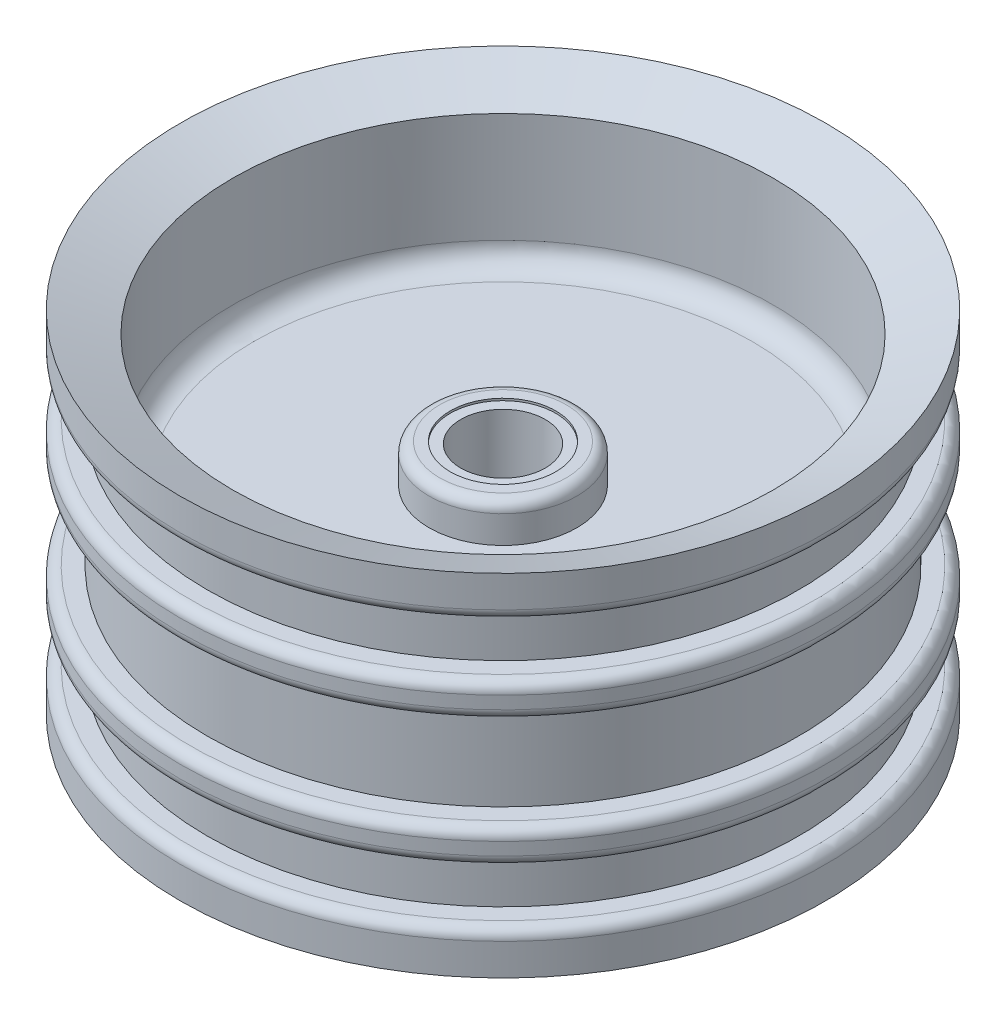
from build123d import *

# Parameters (mm, degrees)
SKETCH_1_R          = 14
EXTRUDE_1_DEPTH     = 16.6
SKETCH_3_R          = 12.8
CUT_EXTRUDE_1_DEPTH = 7.2
CUT_EXTRUDE_START   = -7.8
SKETCH_4_R          = 12.8
CUT_EXTRUDE_2_DEPTH = 7.8
SKETCH_6_R          = 3.5
EXTRUDE_2_DEPTH     = 1.8
SKETCH_7_R          = 2.5
CUT_EXTRUDE_3_DEPTH = 0.1
SKETCH_8_R          = 5
EXTRUDE_3_DEPTH     = 7.5
SKETCH_11_R         = 3.5
SKETCH_10_R         = 4.25
SKETCH_12_W         = 14
SKETCH_12_H         = 1
CUT_EXTRUDE_4_DEPTH = 12.5
CUT_EXTRUDE_5_DEPTH = 12.5
SKETCH_14_R         = 2
CUT_EXTRUDE_6_DEPTH = 27.792163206
FILLET_1_R          = 1
FILLET_2_R          = 0.5


with BuildPart() as part:
    # Sketch 1 → Extrude 1 (new body)
    with BuildSketch(Plane(origin=(0, 0, 0), x_dir=(1, 0, 0), z_dir=(0, 1, 0))):
        with Locations(Location((0, 0, 0), (0, 0, 90))):
            Circle(SKETCH_1_R)
    extrude(amount=EXTRUDE_1_DEPTH)

    # Sketch 2 → Revolve 1 (revolve)
    with BuildSketch(Plane.XY, mode=Mode.PRIVATE) as revolve_1_sk:
        with BuildLine():
            Line((15.3, 0), (15.3, 1.5))
            ThreePointArc((15.3, 1.5), (15.153553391, 1.853553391), (14.8, 2))
            Line((14.8, 2), (14, 2))
            Line((14, 2), (14, 0))
            Line((14, 0), (15.3, 0))
        make_face()
        with BuildLine():
            Line((14, 6.1), (14, 4.5))
            Line((14, 4.5), (14.8, 4.5))
            ThreePointArc((14.8, 4.5), (15.153553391, 4.646446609), (15.3, 5))
            Line((15.3, 5), (15.3, 5.6))
            ThreePointArc((15.3, 5.6), (15.153553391, 5.953553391), (14.8, 6.1))
            Line((14.8, 6.1), (14, 6.1))
        make_face()
        with BuildLine():
            Line((14, 16.6), (15.3, 16.6))
            Line((15.3, 16.6), (15.3, 15.1))
            ThreePointArc((15.3, 15.1), (15.153553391, 14.746446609), (14.8, 14.6))
            Line((14.8, 14.6), (14, 14.6))
            Line((14, 14.6), (14, 16.6))
        make_face()
        with BuildLine():
            Line((15.3, 11.6), (15.3, 11))
            ThreePointArc((15.3, 11), (15.153553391, 10.646446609), (14.8, 10.5))
            Line((14.8, 10.5), (14, 10.5))
            Line((14, 10.5), (14, 12.1))
            Line((14, 12.1), (14.8, 12.1))
            ThreePointArc((14.8, 12.1), (15.153553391, 11.953553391), (15.3, 11.6))
        make_face()
    revolve(revolve_1_sk.sketch.rotate(Axis((0, 8.3, 0), (0, 1, 0)), 90), axis=Axis((0, 8.3, 0), (0, 1, 0)))

    # Sketch 3 → Cut-Extrude 1 (cut)
    with BuildSketch(Plane(origin=(0, 16.6, 0), x_dir=(1, 0, 0), z_dir=(0, 1, 0))):
        with Locations(Location((0, 0, 0), (0, 0, 270))):
            Circle(SKETCH_3_R)
    extrude(amount=-CUT_EXTRUDE_1_DEPTH, mode=Mode.SUBTRACT)

    # Sketch 4 → Cut-Extrude 2 (cut)
    with BuildSketch(Plane.XZ.offset(CUT_EXTRUDE_START)):
        with Locations(Location((0, 0, 0), (0, 0, 90))):
            Circle(SKETCH_4_R)
    extrude(amount=CUT_EXTRUDE_2_DEPTH, mode=Mode.SUBTRACT)

    # Sketch 5 → Cut-Revolve 1 (revolve, cut)
    with BuildSketch(Plane(origin=(0, 0, 0), x_dir=(0, 0, -1), z_dir=(1, 0, 0))):
        Polygon((15.3, 16.6), (12.8, 16.6), (12.8, 15.6), align=None)
        Polygon((12.8, 0), (12.8, 1), (15.3, 0), align=None)
    revolve(axis=Axis((0, 8.3, 0), (0, 1, 0)), mode=Mode.SUBTRACT)

    # Sketch 6 → Extrude 2 (add)
    with BuildSketch(Plane(origin=(0, 9.4, 0), x_dir=(1, 0, 0), z_dir=(0, 1, 0))):
        with Locations(Location((0, 0, 0), (0, 0, 270))):
            Circle(SKETCH_6_R)
    extrude(amount=EXTRUDE_2_DEPTH)

    # Sketch 7 → Cut-Extrude 3 (cut)
    with BuildSketch(Plane(origin=(0, 11.2, 0), x_dir=(1, 0, 0), z_dir=(0, 1, 0))):
        with Locations(Location((0, 0, 0), (0, 0, 270))):
            Circle(SKETCH_7_R)
    extrude(amount=-CUT_EXTRUDE_3_DEPTH, mode=Mode.SUBTRACT)

    # Sketch 8 → Extrude 3 (add)
    with BuildSketch(Plane.XZ.offset(-7.8)):
        with Locations(Location((0, 0, 0), (0, 0, 270))):
            Circle(SKETCH_8_R)
    extrude(amount=EXTRUDE_3_DEPTH)

    # Sketch 11 → Loft 1 section 0
    with BuildSketch(Plane(origin=(0, -4.7, 0), x_dir=(-1, 0, 0), z_dir=(0, -1, 0))):
        Circle(SKETCH_11_R)
    # Sketch 10 → Loft 1 section 1
    with BuildSketch(Plane.XZ.offset(-0.3)):
        Circle(SKETCH_10_R)
    loft()

    # Sketch 12 → Cut-Extrude 4 (cut)
    with BuildSketch(Plane.XZ.offset(4.7)):
        Rectangle(SKETCH_12_W, SKETCH_12_H)
    extrude(amount=-CUT_EXTRUDE_4_DEPTH, mode=Mode.SUBTRACT)

    # Sketch 13 → Cut-Extrude 5 (cut)
    with BuildSketch(Plane.XZ.offset(4.7)):
        with BuildLine():
            Line((0.486486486, -3.566977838), (0.486486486, 3.566977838))
            ThreePointArc((0.486486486, 3.566977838), (-0.006821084, 3.599993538), (-0.5, 3.565108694))
            Line((-0.5, 3.565108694), (-0.5, -3.565108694))
            ThreePointArc((-0.5, -3.565108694), (-0.006821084, -3.599993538), (0.486486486, -3.566977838))
        make_face()
    extrude(amount=-CUT_EXTRUDE_5_DEPTH, mode=Mode.SUBTRACT)

    # Sketch 14 → Cut-Extrude 6 (cut, through all)
    with BuildSketch(Plane(origin=(0, 11.1, 0), x_dir=(1, 0, 0), z_dir=(0, 1, 0))):
        with Locations(Location((0, 0, 0), (0, 0, 270))):
            Circle(SKETCH_14_R)
    extrude(amount=-CUT_EXTRUDE_6_DEPTH, mode=Mode.SUBTRACT)

    # Fillet 1
    fillet_1_edges = [part.edges().sort_by_distance(p)[0] for p in [
        (0, 9.4, -12.8),
        (0, 7.8, -12.8),
    ]]
    fillet(fillet_1_edges, radius=FILLET_1_R)

    # Fillet 2
    fillet_2_edges = [part.edges().sort_by_distance(p)[0] for p in [
        (0, 11.2, -3.5),
    ]]
    fillet(fillet_2_edges, radius=FILLET_2_R)


solid = part.part
